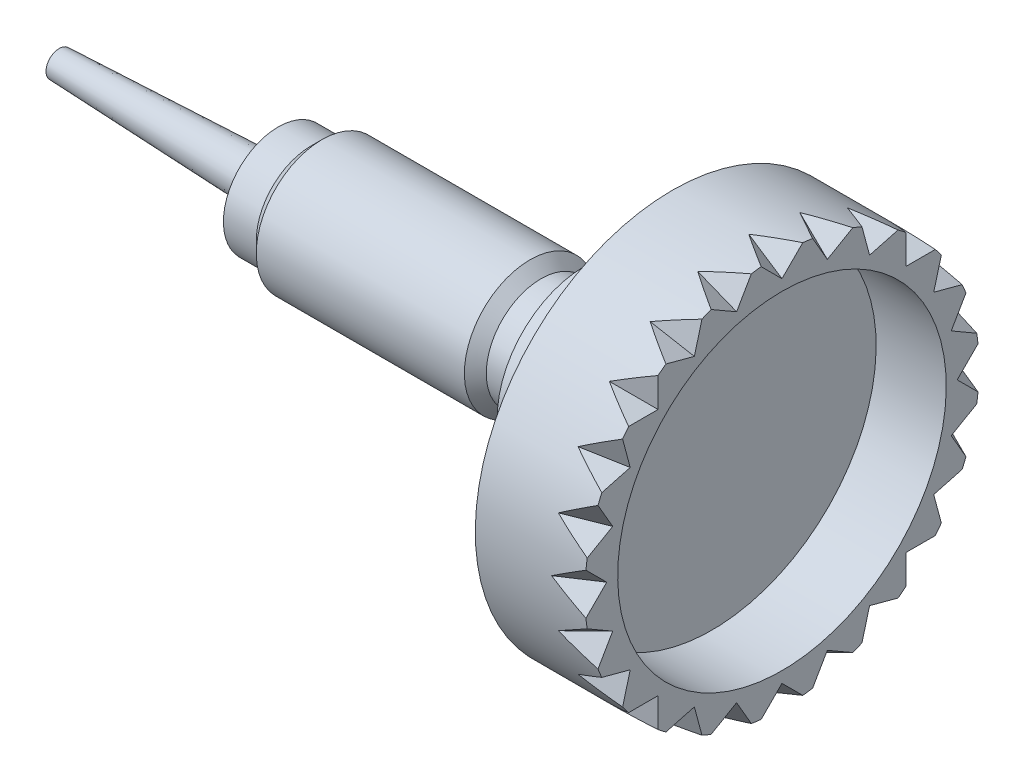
from build123d import *

# Parameters (mm, degrees)
CUT_EXTRUDE1_DEPTH        = 1
CUT_EXTRUDE1_DRAFT        = -25
CIRPATTERN1_COPY_1_DEPTH  = 1
CIRPATTERN1_COPY_1_DRAFT  = -25
CIRPATTERN1_COPY_2_DEPTH  = 1
CIRPATTERN1_COPY_2_DRAFT  = -25
CIRPATTERN1_COPY_3_DEPTH  = 1
CIRPATTERN1_COPY_3_DRAFT  = -25
CIRPATTERN1_COPY_4_DEPTH  = 1
CIRPATTERN1_COPY_4_DRAFT  = -25
CIRPATTERN1_COPY_5_DEPTH  = 1
CIRPATTERN1_COPY_5_DRAFT  = -25
CIRPATTERN1_COPY_6_DEPTH  = 1
CIRPATTERN1_COPY_6_DRAFT  = -25
CIRPATTERN1_COPY_7_DEPTH  = 1
CIRPATTERN1_COPY_7_DRAFT  = -25
CIRPATTERN1_COPY_8_DEPTH  = 1
CIRPATTERN1_COPY_8_DRAFT  = -25
CIRPATTERN1_COPY_9_DEPTH  = 1
CIRPATTERN1_COPY_9_DRAFT  = -25
CIRPATTERN1_COPY_10_DEPTH = 1
CIRPATTERN1_COPY_10_DRAFT = -25
CIRPATTERN1_COPY_11_DEPTH = 1
CIRPATTERN1_COPY_11_DRAFT = -25
CIRPATTERN1_COPY_12_DEPTH = 1
CIRPATTERN1_COPY_12_DRAFT = -25
CIRPATTERN1_COPY_13_DEPTH = 1
CIRPATTERN1_COPY_13_DRAFT = -25
CIRPATTERN1_COPY_14_DEPTH = 1
CIRPATTERN1_COPY_14_DRAFT = -25
CIRPATTERN1_COPY_15_DEPTH = 1
CIRPATTERN1_COPY_15_DRAFT = -25
CIRPATTERN1_COPY_16_DEPTH = 1
CIRPATTERN1_COPY_16_DRAFT = -25
CIRPATTERN1_COPY_17_DEPTH = 1
CIRPATTERN1_COPY_17_DRAFT = -25
CIRPATTERN1_COPY_18_DEPTH = 1
CIRPATTERN1_COPY_18_DRAFT = -25
CIRPATTERN1_COPY_19_DEPTH = 1
CIRPATTERN1_COPY_19_DRAFT = -25
CIRPATTERN1_COPY_20_DEPTH = 1
CIRPATTERN1_COPY_20_DRAFT = -25
CIRPATTERN1_COPY_21_DEPTH = 1
CIRPATTERN1_COPY_21_DRAFT = -25
CIRPATTERN1_COPY_22_DEPTH = 1
CIRPATTERN1_COPY_22_DRAFT = -25
CIRPATTERN1_COPY_23_DEPTH = 1
CIRPATTERN1_COPY_23_DRAFT = -25


with BuildPart() as part:
    # Sketch1 → Revolve1 (revolve)
    with BuildSketch(Plane.XY):
        Polygon((0, 0), (0, 0.3), (5, 0.5), (5, 1.25), (5.75, 1.25), (6, 1.5), (10.75, 1.5), (11, 1.25), (12, 1.25), (12, 2), (14, 2), (14, 4.5), (16.5, 4.5), (16.5, 3.75), (14.9, 3.75), (14.9, 0), align=None)
    revolve(axis=Axis((0, 0, 0), (-1, 0, 0)))


with BuildPart() as cut_extrude1_tool:
    # Sketch2 → Cut-Extrude1 (with draft: the straight prism first)
    with BuildSketch(Plane(origin=(16.5, 0, 0), x_dir=(0, 0, -1), z_dir=(1, 0, 0))):
        Polygon((0, 4), (1.25, 5.25), (-1.25, 5.25), align=None)
    extrude(amount=-CUT_EXTRUDE1_DEPTH)
    # Cut-Extrude1: the draft: its side faces are tilted about the plane it starts from
    cut_extrude1_sides = [cut_extrude1_tool.faces().sort_by_distance(p)[0] for p in [
        (16, 4.625, -0.625),
        (16, 5.25, 0),
        (16, 4.625, 0.625),
    ]]
    draft(cut_extrude1_sides, Plane(origin=(16.5, 0, 0), x_dir=(0, 0, -1), z_dir=(1, 0, 0)), CUT_EXTRUDE1_DRAFT)


with BuildPart() as part_1:
    add(part.part)

    # Cut-Extrude1: cut by cut_extrude1_tool
    add(cut_extrude1_tool.part, mode=Mode.SUBTRACT)


with BuildPart() as cirpattern1_copy_1_tool:
    # CirPattern1 copy 1 sketch → CirPattern1 copy 1 (with draft: the straight prism first)
    with BuildSketch(Plane(origin=(16.5, 0, 0), x_dir=(0, 0.25881904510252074, -0.9659258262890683), z_dir=(1, 0, 0))):
        Polygon((0, 4), (1.25, 5.25), (-1.25, 5.25), align=None)
    extrude(amount=-CIRPATTERN1_COPY_1_DEPTH)
    # CirPattern1 copy 1: the draft: its side faces are tilted about the plane it starts from
    cirpattern1_copy_1_sides = [cirpattern1_copy_1_tool.faces().sort_by_distance(p)[0] for p in [
        (16, 4.62916885, 0.593334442),
        (16, 5.071110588, 1.358799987),
        (16, 4.305645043, 1.800741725),
    ]]
    draft(cirpattern1_copy_1_sides, Plane(origin=(16.5, 0, 0), x_dir=(0, 0.25881904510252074, -0.9659258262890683), z_dir=(1, 0, 0)), CIRPATTERN1_COPY_1_DRAFT)


with BuildPart() as part_2:
    add(part_1.part)

    # CirPattern1 copy 1: cut by cirpattern1_copy_1_tool
    add(cirpattern1_copy_1_tool.part, mode=Mode.SUBTRACT)


with BuildPart() as cirpattern1_copy_2_tool:
    # CirPattern1 copy 2 sketch → CirPattern1 copy 2 (with draft: the straight prism first)
    with BuildSketch(Plane(origin=(16.5, 0, 0), x_dir=(0, 0.49999999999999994, -0.8660254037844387), z_dir=(1, 0, 0))):
        Polygon((0, 4), (1.25, 5.25), (-1.25, 5.25), align=None)
    extrude(amount=-CIRPATTERN1_COPY_2_DEPTH)
    # CirPattern1 copy 2: the draft: its side faces are tilted about the plane it starts from
    cirpattern1_copy_2_sides = [cirpattern1_copy_2_tool.faces().sort_by_distance(p)[0] for p in [
        (16, 4.317867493, 1.771234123),
        (16, 4.54663337, 2.625),
        (16, 3.692867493, 2.853765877),
    ]]
    draft(cirpattern1_copy_2_sides, Plane(origin=(16.5, 0, 0), x_dir=(0, 0.49999999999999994, -0.8660254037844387), z_dir=(1, 0, 0)), CIRPATTERN1_COPY_2_DRAFT)


with BuildPart() as part_3:
    add(part_2.part)

    # CirPattern1 copy 2: cut by cirpattern1_copy_2_tool
    add(cirpattern1_copy_2_tool.part, mode=Mode.SUBTRACT)


with BuildPart() as cirpattern1_copy_3_tool:
    # CirPattern1 copy 3 sketch → CirPattern1 copy 3 (with draft: the straight prism first)
    with BuildSketch(Plane(origin=(16.5, 0, 0), x_dir=(0, 0.7071067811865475, -0.7071067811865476), z_dir=(1, 0, 0))):
        Polygon((0, 4), (1.25, 5.25), (-1.25, 5.25), align=None)
    extrude(amount=-CIRPATTERN1_COPY_3_DEPTH)
    # CirPattern1 copy 3: the draft: its side faces are tilted about the plane it starts from
    cirpattern1_copy_3_sides = [cirpattern1_copy_3_tool.faces().sort_by_distance(p)[0] for p in [
        (16, 3.712310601, 2.828427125),
        (16, 3.712310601, 3.712310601),
        (16, 2.828427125, 3.712310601),
    ]]
    draft(cirpattern1_copy_3_sides, Plane(origin=(16.5, 0, 0), x_dir=(0, 0.7071067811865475, -0.7071067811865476), z_dir=(1, 0, 0)), CIRPATTERN1_COPY_3_DRAFT)


with BuildPart() as part_4:
    add(part_3.part)

    # CirPattern1 copy 3: cut by cirpattern1_copy_3_tool
    add(cirpattern1_copy_3_tool.part, mode=Mode.SUBTRACT)


with BuildPart() as cirpattern1_copy_4_tool:
    # CirPattern1 copy 4 sketch → CirPattern1 copy 4 (with draft: the straight prism first)
    with BuildSketch(Plane(origin=(16.5, 0, 0), x_dir=(0, 0.8660254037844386, -0.5000000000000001), z_dir=(1, 0, 0))):
        Polygon((0, 4), (1.25, 5.25), (-1.25, 5.25), align=None)
    extrude(amount=-CIRPATTERN1_COPY_4_DEPTH)
    # CirPattern1 copy 4: the draft: its side faces are tilted about the plane it starts from
    cirpattern1_copy_4_sides = [cirpattern1_copy_4_tool.faces().sort_by_distance(p)[0] for p in [
        (16, 2.853765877, 3.692867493),
        (16, 2.625, 4.54663337),
        (16, 1.771234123, 4.317867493),
    ]]
    draft(cirpattern1_copy_4_sides, Plane(origin=(16.5, 0, 0), x_dir=(0, 0.8660254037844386, -0.5000000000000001), z_dir=(1, 0, 0)), CIRPATTERN1_COPY_4_DRAFT)


with BuildPart() as part_5:
    add(part_4.part)

    # CirPattern1 copy 4: cut by cirpattern1_copy_4_tool
    add(cirpattern1_copy_4_tool.part, mode=Mode.SUBTRACT)


with BuildPart() as cirpattern1_copy_5_tool:
    # CirPattern1 copy 5 sketch → CirPattern1 copy 5 (with draft: the straight prism first)
    with BuildSketch(Plane(origin=(16.5, 0, 0), x_dir=(0, 0.9659258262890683, -0.25881904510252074), z_dir=(1, 0, 0))):
        Polygon((0, 4), (1.25, 5.25), (-1.25, 5.25), align=None)
    extrude(amount=-CIRPATTERN1_COPY_5_DEPTH)
    # CirPattern1 copy 5: the draft: its side faces are tilted about the plane it starts from
    cirpattern1_copy_5_sides = [cirpattern1_copy_5_tool.faces().sort_by_distance(p)[0] for p in [
        (16, 1.800741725, 4.305645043),
        (16, 1.358799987, 5.071110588),
        (16, 0.593334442, 4.62916885),
    ]]
    draft(cirpattern1_copy_5_sides, Plane(origin=(16.5, 0, 0), x_dir=(0, 0.9659258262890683, -0.25881904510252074), z_dir=(1, 0, 0)), CIRPATTERN1_COPY_5_DRAFT)


with BuildPart() as part_6:
    add(part_5.part)

    # CirPattern1 copy 5: cut by cirpattern1_copy_5_tool
    add(cirpattern1_copy_5_tool.part, mode=Mode.SUBTRACT)


with BuildPart() as cirpattern1_copy_6_tool:
    # CirPattern1 copy 6 sketch → CirPattern1 copy 6 (with draft: the straight prism first)
    with BuildSketch(Plane.YZ.offset(16.5)):
        Polygon((0, 4), (1.25, 5.25), (-1.25, 5.25), align=None)
    extrude(amount=-CIRPATTERN1_COPY_6_DEPTH)
    # CirPattern1 copy 6: the draft: its side faces are tilted about the plane it starts from
    cirpattern1_copy_6_sides = [cirpattern1_copy_6_tool.faces().sort_by_distance(p)[0] for p in [
        (16, 0.625, 4.625),
        (16, 0, 5.25),
        (16, -0.625, 4.625),
    ]]
    draft(cirpattern1_copy_6_sides, Plane.YZ.offset(16.5), CIRPATTERN1_COPY_6_DRAFT)


with BuildPart() as part_7:
    add(part_6.part)

    # CirPattern1 copy 6: cut by cirpattern1_copy_6_tool
    add(cirpattern1_copy_6_tool.part, mode=Mode.SUBTRACT)


with BuildPart() as cirpattern1_copy_7_tool:
    # CirPattern1 copy 7 sketch → CirPattern1 copy 7 (with draft: the straight prism first)
    with BuildSketch(Plane(origin=(16.5, 0, 0), x_dir=(0, 0.9659258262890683, 0.25881904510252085), z_dir=(1, 0, 0))):
        Polygon((0, 4), (1.25, 5.25), (-1.25, 5.25), align=None)
    extrude(amount=-CIRPATTERN1_COPY_7_DEPTH)
    # CirPattern1 copy 7: the draft: its side faces are tilted about the plane it starts from
    cirpattern1_copy_7_sides = [cirpattern1_copy_7_tool.faces().sort_by_distance(p)[0] for p in [
        (16, -0.593334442, 4.62916885),
        (16, -1.358799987, 5.071110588),
        (16, -1.800741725, 4.305645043),
    ]]
    draft(cirpattern1_copy_7_sides, Plane(origin=(16.5, 0, 0), x_dir=(0, 0.9659258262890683, 0.25881904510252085), z_dir=(1, 0, 0)), CIRPATTERN1_COPY_7_DRAFT)


with BuildPart() as part_8:
    add(part_7.part)

    # CirPattern1 copy 7: cut by cirpattern1_copy_7_tool
    add(cirpattern1_copy_7_tool.part, mode=Mode.SUBTRACT)


with BuildPart() as cirpattern1_copy_8_tool:
    # CirPattern1 copy 8 sketch → CirPattern1 copy 8 (with draft: the straight prism first)
    with BuildSketch(Plane(origin=(16.5, 0, 0), x_dir=(0, 0.8660254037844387, 0.4999999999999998), z_dir=(1, 0, 0))):
        Polygon((0, 4), (1.25, 5.25), (-1.25, 5.25), align=None)
    extrude(amount=-CIRPATTERN1_COPY_8_DEPTH)
    # CirPattern1 copy 8: the draft: its side faces are tilted about the plane it starts from
    cirpattern1_copy_8_sides = [cirpattern1_copy_8_tool.faces().sort_by_distance(p)[0] for p in [
        (16, -1.771234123, 4.317867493),
        (16, -2.625, 4.54663337),
        (16, -2.853765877, 3.692867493),
    ]]
    draft(cirpattern1_copy_8_sides, Plane(origin=(16.5, 0, 0), x_dir=(0, 0.8660254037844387, 0.4999999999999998), z_dir=(1, 0, 0)), CIRPATTERN1_COPY_8_DRAFT)


with BuildPart() as part_9:
    add(part_8.part)

    # CirPattern1 copy 8: cut by cirpattern1_copy_8_tool
    add(cirpattern1_copy_8_tool.part, mode=Mode.SUBTRACT)


with BuildPart() as cirpattern1_copy_9_tool:
    # CirPattern1 copy 9 sketch → CirPattern1 copy 9 (with draft: the straight prism first)
    with BuildSketch(Plane(origin=(16.5, 0, 0), x_dir=(0, 0.7071067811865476, 0.7071067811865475), z_dir=(1, 0, 0))):
        Polygon((0, 4), (1.25, 5.25), (-1.25, 5.25), align=None)
    extrude(amount=-CIRPATTERN1_COPY_9_DEPTH)
    # CirPattern1 copy 9: the draft: its side faces are tilted about the plane it starts from
    cirpattern1_copy_9_sides = [cirpattern1_copy_9_tool.faces().sort_by_distance(p)[0] for p in [
        (16, -2.828427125, 3.712310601),
        (16, -3.712310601, 3.712310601),
        (16, -3.712310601, 2.828427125),
    ]]
    draft(cirpattern1_copy_9_sides, Plane(origin=(16.5, 0, 0), x_dir=(0, 0.7071067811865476, 0.7071067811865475), z_dir=(1, 0, 0)), CIRPATTERN1_COPY_9_DRAFT)


with BuildPart() as part_10:
    add(part_9.part)

    # CirPattern1 copy 9: cut by cirpattern1_copy_9_tool
    add(cirpattern1_copy_9_tool.part, mode=Mode.SUBTRACT)


with BuildPart() as cirpattern1_copy_10_tool:
    # CirPattern1 copy 10 sketch → CirPattern1 copy 10 (with draft: the straight prism first)
    with BuildSketch(Plane(origin=(16.5, 0, 0), x_dir=(0, 0.49999999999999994, 0.8660254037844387), z_dir=(1, 0, 0))):
        Polygon((0, 4), (1.25, 5.25), (-1.25, 5.25), align=None)
    extrude(amount=-CIRPATTERN1_COPY_10_DEPTH)
    # CirPattern1 copy 10: the draft: its side faces are tilted about the plane it starts from
    cirpattern1_copy_10_sides = [cirpattern1_copy_10_tool.faces().sort_by_distance(p)[0] for p in [
        (16, -3.692867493, 2.853765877),
        (16, -4.54663337, 2.625),
        (16, -4.317867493, 1.771234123),
    ]]
    draft(cirpattern1_copy_10_sides, Plane(origin=(16.5, 0, 0), x_dir=(0, 0.49999999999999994, 0.8660254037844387), z_dir=(1, 0, 0)), CIRPATTERN1_COPY_10_DRAFT)


with BuildPart() as part_11:
    add(part_10.part)

    # CirPattern1 copy 10: cut by cirpattern1_copy_10_tool
    add(cirpattern1_copy_10_tool.part, mode=Mode.SUBTRACT)


with BuildPart() as cirpattern1_copy_11_tool:
    # CirPattern1 copy 11 sketch → CirPattern1 copy 11 (with draft: the straight prism first)
    with BuildSketch(Plane(origin=(16.5, 0, 0), x_dir=(0, 0.258819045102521, 0.9659258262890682), z_dir=(1, 0, 0))):
        Polygon((0, 4), (1.25, 5.25), (-1.25, 5.25), align=None)
    extrude(amount=-CIRPATTERN1_COPY_11_DEPTH)
    # CirPattern1 copy 11: the draft: its side faces are tilted about the plane it starts from
    cirpattern1_copy_11_sides = [cirpattern1_copy_11_tool.faces().sort_by_distance(p)[0] for p in [
        (16, -4.305645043, 1.800741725),
        (16, -5.071110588, 1.358799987),
        (16, -4.62916885, 0.593334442),
    ]]
    draft(cirpattern1_copy_11_sides, Plane(origin=(16.5, 0, 0), x_dir=(0, 0.258819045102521, 0.9659258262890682), z_dir=(1, 0, 0)), CIRPATTERN1_COPY_11_DRAFT)


with BuildPart() as part_12:
    add(part_11.part)

    # CirPattern1 copy 11: cut by cirpattern1_copy_11_tool
    add(cirpattern1_copy_11_tool.part, mode=Mode.SUBTRACT)


with BuildPart() as cirpattern1_copy_12_tool:
    # CirPattern1 copy 12 sketch → CirPattern1 copy 12 (with draft: the straight prism first)
    with BuildSketch(Plane(origin=(16.5, 0, 0), x_dir=(0, 0, 1), z_dir=(1, 0, 0))):
        Polygon((0, 4), (1.25, 5.25), (-1.25, 5.25), align=None)
    extrude(amount=-CIRPATTERN1_COPY_12_DEPTH)
    # CirPattern1 copy 12: the draft: its side faces are tilted about the plane it starts from
    cirpattern1_copy_12_sides = [cirpattern1_copy_12_tool.faces().sort_by_distance(p)[0] for p in [
        (16, -4.625, 0.625),
        (16, -5.25, 0),
        (16, -4.625, -0.625),
    ]]
    draft(cirpattern1_copy_12_sides, Plane(origin=(16.5, 0, 0), x_dir=(0, 0, 1), z_dir=(1, 0, 0)), CIRPATTERN1_COPY_12_DRAFT)


with BuildPart() as part_13:
    add(part_12.part)

    # CirPattern1 copy 12: cut by cirpattern1_copy_12_tool
    add(cirpattern1_copy_12_tool.part, mode=Mode.SUBTRACT)


with BuildPart() as cirpattern1_copy_13_tool:
    # CirPattern1 copy 13 sketch → CirPattern1 copy 13 (with draft: the straight prism first)
    with BuildSketch(Plane(origin=(16.5, 0, 0), x_dir=(0, -0.2588190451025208, 0.9659258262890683), z_dir=(1, 0, 0))):
        Polygon((0, 4), (1.25, 5.25), (-1.25, 5.25), align=None)
    extrude(amount=-CIRPATTERN1_COPY_13_DEPTH)
    # CirPattern1 copy 13: the draft: its side faces are tilted about the plane it starts from
    cirpattern1_copy_13_sides = [cirpattern1_copy_13_tool.faces().sort_by_distance(p)[0] for p in [
        (16, -4.62916885, -0.593334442),
        (16, -5.071110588, -1.358799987),
        (16, -4.305645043, -1.800741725),
    ]]
    draft(cirpattern1_copy_13_sides, Plane(origin=(16.5, 0, 0), x_dir=(0, -0.2588190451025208, 0.9659258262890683), z_dir=(1, 0, 0)), CIRPATTERN1_COPY_13_DRAFT)


with BuildPart() as part_14:
    add(part_13.part)

    # CirPattern1 copy 13: cut by cirpattern1_copy_13_tool
    add(cirpattern1_copy_13_tool.part, mode=Mode.SUBTRACT)


with BuildPart() as cirpattern1_copy_14_tool:
    # CirPattern1 copy 14 sketch → CirPattern1 copy 14 (with draft: the straight prism first)
    with BuildSketch(Plane(origin=(16.5, 0, 0), x_dir=(0, -0.5000000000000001, 0.8660254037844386), z_dir=(1, 0, 0))):
        Polygon((0, 4), (1.25, 5.25), (-1.25, 5.25), align=None)
    extrude(amount=-CIRPATTERN1_COPY_14_DEPTH)
    # CirPattern1 copy 14: the draft: its side faces are tilted about the plane it starts from
    cirpattern1_copy_14_sides = [cirpattern1_copy_14_tool.faces().sort_by_distance(p)[0] for p in [
        (16, -4.317867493, -1.771234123),
        (16, -4.54663337, -2.625),
        (16, -3.692867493, -2.853765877),
    ]]
    draft(cirpattern1_copy_14_sides, Plane(origin=(16.5, 0, 0), x_dir=(0, -0.5000000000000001, 0.8660254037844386), z_dir=(1, 0, 0)), CIRPATTERN1_COPY_14_DRAFT)


with BuildPart() as part_15:
    add(part_14.part)

    # CirPattern1 copy 14: cut by cirpattern1_copy_14_tool
    add(cirpattern1_copy_14_tool.part, mode=Mode.SUBTRACT)


with BuildPart() as cirpattern1_copy_15_tool:
    # CirPattern1 copy 15 sketch → CirPattern1 copy 15 (with draft: the straight prism first)
    with BuildSketch(Plane(origin=(16.5, 0, 0), x_dir=(0, -0.7071067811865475, 0.7071067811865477), z_dir=(1, 0, 0))):
        Polygon((0, 4), (1.25, 5.25), (-1.25, 5.25), align=None)
    extrude(amount=-CIRPATTERN1_COPY_15_DEPTH)
    # CirPattern1 copy 15: the draft: its side faces are tilted about the plane it starts from
    cirpattern1_copy_15_sides = [cirpattern1_copy_15_tool.faces().sort_by_distance(p)[0] for p in [
        (16, -3.712310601, -2.828427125),
        (16, -3.712310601, -3.712310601),
        (16, -2.828427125, -3.712310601),
    ]]
    draft(cirpattern1_copy_15_sides, Plane(origin=(16.5, 0, 0), x_dir=(0, -0.7071067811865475, 0.7071067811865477), z_dir=(1, 0, 0)), CIRPATTERN1_COPY_15_DRAFT)


with BuildPart() as part_16:
    add(part_15.part)

    # CirPattern1 copy 15: cut by cirpattern1_copy_15_tool
    add(cirpattern1_copy_15_tool.part, mode=Mode.SUBTRACT)


with BuildPart() as cirpattern1_copy_16_tool:
    # CirPattern1 copy 16 sketch → CirPattern1 copy 16 (with draft: the straight prism first)
    with BuildSketch(Plane(origin=(16.5, 0, 0), x_dir=(0, -0.8660254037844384, 0.5000000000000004), z_dir=(1, 0, 0))):
        Polygon((0, 4), (1.25, 5.25), (-1.25, 5.25), align=None)
    extrude(amount=-CIRPATTERN1_COPY_16_DEPTH)
    # CirPattern1 copy 16: the draft: its side faces are tilted about the plane it starts from
    cirpattern1_copy_16_sides = [cirpattern1_copy_16_tool.faces().sort_by_distance(p)[0] for p in [
        (16, -2.853765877, -3.692867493),
        (16, -2.625, -4.54663337),
        (16, -1.771234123, -4.317867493),
    ]]
    draft(cirpattern1_copy_16_sides, Plane(origin=(16.5, 0, 0), x_dir=(0, -0.8660254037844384, 0.5000000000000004), z_dir=(1, 0, 0)), CIRPATTERN1_COPY_16_DRAFT)


with BuildPart() as part_17:
    add(part_16.part)

    # CirPattern1 copy 16: cut by cirpattern1_copy_16_tool
    add(cirpattern1_copy_16_tool.part, mode=Mode.SUBTRACT)


with BuildPart() as cirpattern1_copy_17_tool:
    # CirPattern1 copy 17 sketch → CirPattern1 copy 17 (with draft: the straight prism first)
    with BuildSketch(Plane(origin=(16.5, 0, 0), x_dir=(0, -0.9659258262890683, 0.25881904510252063), z_dir=(1, 0, 0))):
        Polygon((0, 4), (1.25, 5.25), (-1.25, 5.25), align=None)
    extrude(amount=-CIRPATTERN1_COPY_17_DEPTH)
    # CirPattern1 copy 17: the draft: its side faces are tilted about the plane it starts from
    cirpattern1_copy_17_sides = [cirpattern1_copy_17_tool.faces().sort_by_distance(p)[0] for p in [
        (16, -1.800741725, -4.305645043),
        (16, -1.358799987, -5.071110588),
        (16, -0.593334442, -4.62916885),
    ]]
    draft(cirpattern1_copy_17_sides, Plane(origin=(16.5, 0, 0), x_dir=(0, -0.9659258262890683, 0.25881904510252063), z_dir=(1, 0, 0)), CIRPATTERN1_COPY_17_DRAFT)


with BuildPart() as part_18:
    add(part_17.part)

    # CirPattern1 copy 17: cut by cirpattern1_copy_17_tool
    add(cirpattern1_copy_17_tool.part, mode=Mode.SUBTRACT)


with BuildPart() as cirpattern1_copy_18_tool:
    # CirPattern1 copy 18 sketch → CirPattern1 copy 18 (with draft: the straight prism first)
    with BuildSketch(Plane(origin=(16.5, 0, 0), x_dir=(0, -1, 0), z_dir=(1, 0, 0))):
        Polygon((0, 4), (1.25, 5.25), (-1.25, 5.25), align=None)
    extrude(amount=-CIRPATTERN1_COPY_18_DEPTH)
    # CirPattern1 copy 18: the draft: its side faces are tilted about the plane it starts from
    cirpattern1_copy_18_sides = [cirpattern1_copy_18_tool.faces().sort_by_distance(p)[0] for p in [
        (16, -0.625, -4.625),
        (16, 0, -5.25),
        (16, 0.625, -4.625),
    ]]
    draft(cirpattern1_copy_18_sides, Plane(origin=(16.5, 0, 0), x_dir=(0, -1, 0), z_dir=(1, 0, 0)), CIRPATTERN1_COPY_18_DRAFT)


with BuildPart() as part_19:
    add(part_18.part)

    # CirPattern1 copy 18: cut by cirpattern1_copy_18_tool
    add(cirpattern1_copy_18_tool.part, mode=Mode.SUBTRACT)


with BuildPart() as cirpattern1_copy_19_tool:
    # CirPattern1 copy 19 sketch → CirPattern1 copy 19 (with draft: the straight prism first)
    with BuildSketch(Plane(origin=(16.5, 0, 0), x_dir=(0, -0.9659258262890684, -0.2588190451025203), z_dir=(1, 0, 0))):
        Polygon((0, 4), (1.25, 5.25), (-1.25, 5.25), align=None)
    extrude(amount=-CIRPATTERN1_COPY_19_DEPTH)
    # CirPattern1 copy 19: the draft: its side faces are tilted about the plane it starts from
    cirpattern1_copy_19_sides = [cirpattern1_copy_19_tool.faces().sort_by_distance(p)[0] for p in [
        (16, 0.593334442, -4.62916885),
        (16, 1.358799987, -5.071110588),
        (16, 1.800741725, -4.305645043),
    ]]
    draft(cirpattern1_copy_19_sides, Plane(origin=(16.5, 0, 0), x_dir=(0, -0.9659258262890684, -0.2588190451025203), z_dir=(1, 0, 0)), CIRPATTERN1_COPY_19_DRAFT)


with BuildPart() as part_20:
    add(part_19.part)

    # CirPattern1 copy 19: cut by cirpattern1_copy_19_tool
    add(cirpattern1_copy_19_tool.part, mode=Mode.SUBTRACT)


with BuildPart() as cirpattern1_copy_20_tool:
    # CirPattern1 copy 20 sketch → CirPattern1 copy 20 (with draft: the straight prism first)
    with BuildSketch(Plane(origin=(16.5, 0, 0), x_dir=(0, -0.8660254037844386, -0.5000000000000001), z_dir=(1, 0, 0))):
        Polygon((0, 4), (1.25, 5.25), (-1.25, 5.25), align=None)
    extrude(amount=-CIRPATTERN1_COPY_20_DEPTH)
    # CirPattern1 copy 20: the draft: its side faces are tilted about the plane it starts from
    cirpattern1_copy_20_sides = [cirpattern1_copy_20_tool.faces().sort_by_distance(p)[0] for p in [
        (16, 1.771234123, -4.317867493),
        (16, 2.625, -4.54663337),
        (16, 2.853765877, -3.692867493),
    ]]
    draft(cirpattern1_copy_20_sides, Plane(origin=(16.5, 0, 0), x_dir=(0, -0.8660254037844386, -0.5000000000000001), z_dir=(1, 0, 0)), CIRPATTERN1_COPY_20_DRAFT)


with BuildPart() as part_21:
    add(part_20.part)

    # CirPattern1 copy 20: cut by cirpattern1_copy_20_tool
    add(cirpattern1_copy_20_tool.part, mode=Mode.SUBTRACT)


with BuildPart() as cirpattern1_copy_21_tool:
    # CirPattern1 copy 21 sketch → CirPattern1 copy 21 (with draft: the straight prism first)
    with BuildSketch(Plane(origin=(16.5, 0, 0), x_dir=(0, -0.7071067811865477, -0.7071067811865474), z_dir=(1, 0, 0))):
        Polygon((0, 4), (1.25, 5.25), (-1.25, 5.25), align=None)
    extrude(amount=-CIRPATTERN1_COPY_21_DEPTH)
    # CirPattern1 copy 21: the draft: its side faces are tilted about the plane it starts from
    cirpattern1_copy_21_sides = [cirpattern1_copy_21_tool.faces().sort_by_distance(p)[0] for p in [
        (16, 2.828427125, -3.712310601),
        (16, 3.712310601, -3.712310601),
        (16, 3.712310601, -2.828427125),
    ]]
    draft(cirpattern1_copy_21_sides, Plane(origin=(16.5, 0, 0), x_dir=(0, -0.7071067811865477, -0.7071067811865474), z_dir=(1, 0, 0)), CIRPATTERN1_COPY_21_DRAFT)


with BuildPart() as part_22:
    add(part_21.part)

    # CirPattern1 copy 21: cut by cirpattern1_copy_21_tool
    add(cirpattern1_copy_21_tool.part, mode=Mode.SUBTRACT)


with BuildPart() as cirpattern1_copy_22_tool:
    # CirPattern1 copy 22 sketch → CirPattern1 copy 22 (with draft: the straight prism first)
    with BuildSketch(Plane(origin=(16.5, 0, 0), x_dir=(0, -0.5000000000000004, -0.8660254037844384), z_dir=(1, 0, 0))):
        Polygon((0, 4), (1.25, 5.25), (-1.25, 5.25), align=None)
    extrude(amount=-CIRPATTERN1_COPY_22_DEPTH)
    # CirPattern1 copy 22: the draft: its side faces are tilted about the plane it starts from
    cirpattern1_copy_22_sides = [cirpattern1_copy_22_tool.faces().sort_by_distance(p)[0] for p in [
        (16, 3.692867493, -2.853765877),
        (16, 4.54663337, -2.625),
        (16, 4.317867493, -1.771234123),
    ]]
    draft(cirpattern1_copy_22_sides, Plane(origin=(16.5, 0, 0), x_dir=(0, -0.5000000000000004, -0.8660254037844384), z_dir=(1, 0, 0)), CIRPATTERN1_COPY_22_DRAFT)


with BuildPart() as part_23:
    add(part_22.part)

    # CirPattern1 copy 22: cut by cirpattern1_copy_22_tool
    add(cirpattern1_copy_22_tool.part, mode=Mode.SUBTRACT)


with BuildPart() as cirpattern1_copy_23_tool:
    # CirPattern1 copy 23 sketch → CirPattern1 copy 23 (with draft: the straight prism first)
    with BuildSketch(Plane(origin=(16.5, 0, 0), x_dir=(0, -0.2588190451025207, -0.9659258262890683), z_dir=(1, 0, 0))):
        Polygon((0, 4), (1.25, 5.25), (-1.25, 5.25), align=None)
    extrude(amount=-CIRPATTERN1_COPY_23_DEPTH)
    # CirPattern1 copy 23: the draft: its side faces are tilted about the plane it starts from
    cirpattern1_copy_23_sides = [cirpattern1_copy_23_tool.faces().sort_by_distance(p)[0] for p in [
        (16, 4.305645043, -1.800741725),
        (16, 5.071110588, -1.358799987),
        (16, 4.62916885, -0.593334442),
    ]]
    draft(cirpattern1_copy_23_sides, Plane(origin=(16.5, 0, 0), x_dir=(0, -0.2588190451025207, -0.9659258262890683), z_dir=(1, 0, 0)), CIRPATTERN1_COPY_23_DRAFT)


with BuildPart() as part_24:
    add(part_23.part)

    # CirPattern1 copy 23: cut by cirpattern1_copy_23_tool
    add(cirpattern1_copy_23_tool.part, mode=Mode.SUBTRACT)


solid = part_24.part
